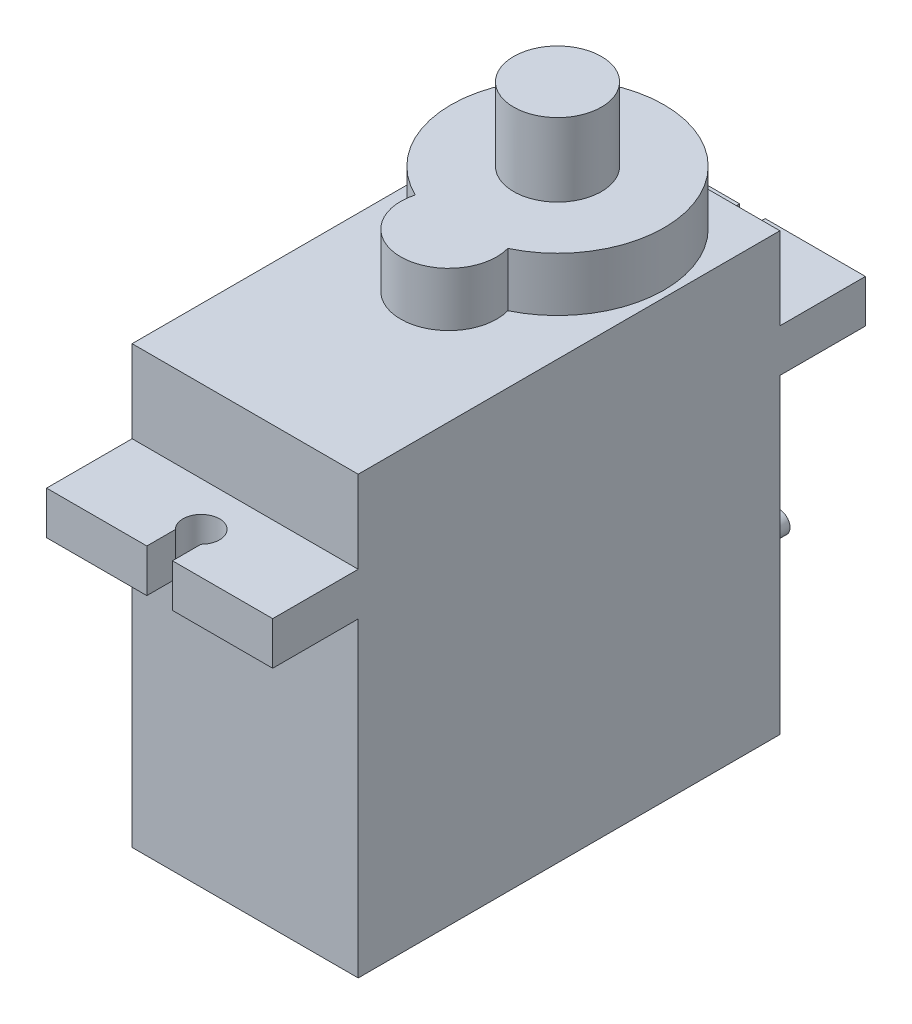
from build123d import *

# Parameters (mm, degrees)
ESQUISSE1_W             = 12.36
ESQUISSE1_H             = 23.05
BOSS_EXTRU_1_DEPTH      = 17
ESQUISSE2_W             = 12.36
ESQUISSE2_H             = 32.4
BOSS_EXTRU_2_DEPTH      = 2.35
ENL_V_MAT_EXTRU_1_DEPTH = 35.369907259
ESQUISSE4_W             = 12.36
ESQUISSE4_H             = 23.05
BOSS_EXTRU_3_DEPTH      = 4.5
BOSS_EXTRU_4_DEPTH      = 2.95
ESQUISSE6_R             = 2.4
BOSS_EXTRU_5_DEPTH      = 4
ESQUISSE7_R             = 0.575
BOSS_EXTRU_6_DEPTH      = 5


with BuildPart() as part:
    # Esquisse1 → Boss.-Extru.1 (new body)
    with BuildSketch(Plane(origin=(0, 0, 0), x_dir=(1, 0, 0), z_dir=(0, 1, 0))):
        with Locations((0, 11.525)):
            Rectangle(ESQUISSE1_W, ESQUISSE1_H)
    extrude(amount=BOSS_EXTRU_1_DEPTH)

    # Esquisse2 → Boss.-Extru.2 (add)
    with BuildSketch(Plane(origin=(0, 17, 0), x_dir=(1, 0, 0), z_dir=(0, 1, 0))):
        with Locations((0, 11.525)):
            Rectangle(ESQUISSE2_W, ESQUISSE2_H)
    extrude(amount=BOSS_EXTRU_2_DEPTH)

    # Esquisse3 → Enl_v. mat.-Extru.1 (cut, through all)
    with BuildSketch(Plane(origin=(0, 19.35, 0), x_dir=(1, 0, 0), z_dir=(0, 1, 0))):
        with BuildLine():
            Line((-0.7, 27.725), (0.7, 27.725))
            Line((0.7, 27.725), (0.7, 26.164142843))
            ThreePointArc((0.7, 26.164142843), (0, 24.45), (-0.7, 26.164142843))
            Line((-0.7, 26.164142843), (-0.7, 27.725))
        make_face()
        with BuildLine():
            Line((-0.7, -4.675), (0.7, -4.675))
            Line((0.7, -4.675), (0.7, -3.114142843))
            ThreePointArc((0.7, -3.114142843), (0, -1.4), (-0.7, -3.114142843))
            Line((-0.7, -3.114142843), (-0.7, -4.675))
        make_face()
    extrude(amount=-ENL_V_MAT_EXTRU_1_DEPTH, mode=Mode.SUBTRACT)

    # Esquisse4 → Boss.-Extru.3 (add)
    with BuildSketch(Plane(origin=(0, 19.35, 0), x_dir=(1, 0, 0), z_dir=(0, 1, 0))):
        with Locations((0, 11.525)):
            Rectangle(ESQUISSE4_W, ESQUISSE4_H)
    extrude(amount=BOSS_EXTRU_3_DEPTH)

    # Esquisse5 → Boss.-Extru.4 (add)
    with BuildSketch(Plane(origin=(0, 23.85, 0), x_dir=(1, 0, 0), z_dir=(0, 1, 0))):
        with BuildLine():
            ThreePointArc((2.52918841, 11.827731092), (0, 22.9), (-2.52918841, 11.827731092))
            ThreePointArc((-2.52918841, 11.827731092), (0, 8.5), (2.52918841, 11.827731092))
        make_face()
    extrude(amount=BOSS_EXTRU_4_DEPTH)

    # Esquisse6 → Boss.-Extru.5 (add)
    with BuildSketch(Plane(origin=(0, 26.8, 0), x_dir=(1, 0, 0), z_dir=(0, 1, 0))):
        with Locations(Location((0, 17.075, 0), (0, 0, 90))):
            Circle(ESQUISSE6_R)
    extrude(amount=BOSS_EXTRU_5_DEPTH)

    # Esquisse7 → Boss.-Extru.6 (add)
    with BuildSketch(Plane.XY.offset(-23.05)):
        with Locations((-1.16, 5.075)):
            Circle(ESQUISSE7_R)
        with Locations((0, 5.075)):
            Circle(ESQUISSE7_R)
        with Locations((1.16, 5.075)):
            Circle(ESQUISSE7_R)
    extrude(amount=-BOSS_EXTRU_6_DEPTH)


solid = part.part
